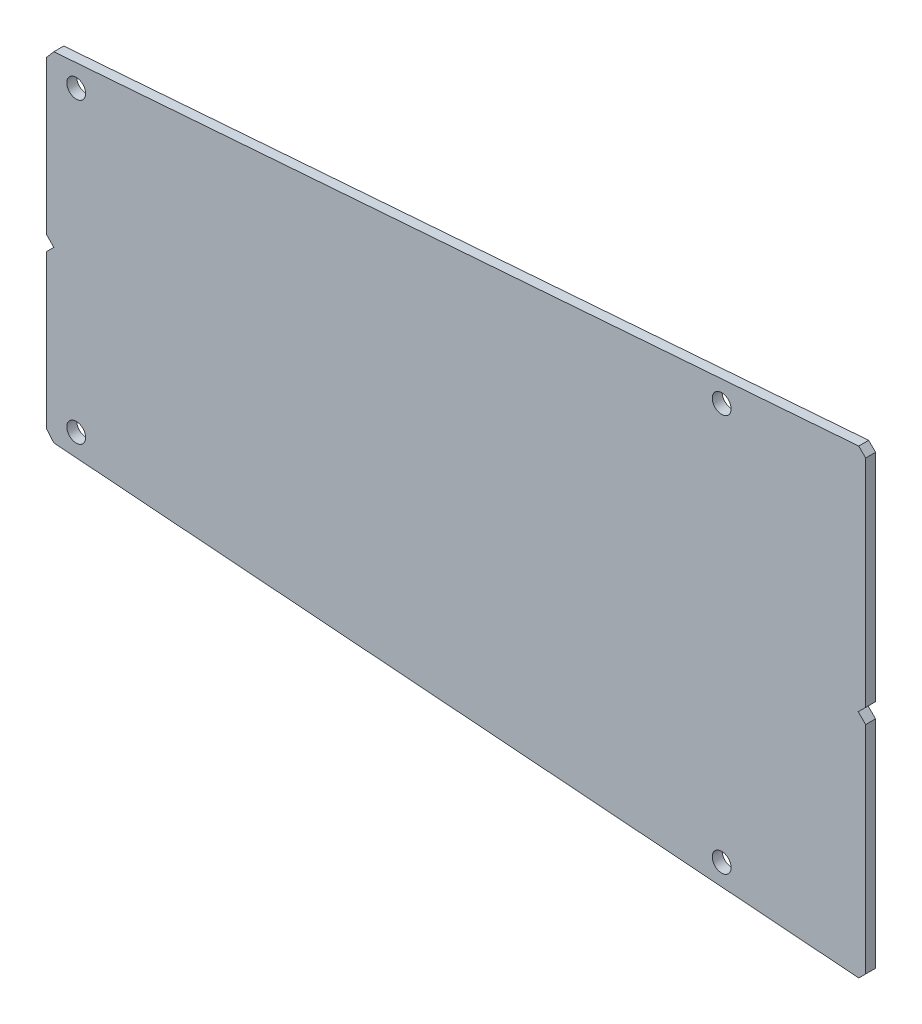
ISO-10303-21;
HEADER;
FILE_DESCRIPTION(('STEP AP214'),'2;1');
FILE_NAME('part.step','',(''),(''),'','','');
FILE_SCHEMA(('AUTOMOTIVE_DESIGN { 1 0 10303 214 1 1 1 1 }'));
ENDSEC;
DATA;
#1=APPLICATION_CONTEXT('core data for automotive mechanical design processes');
#2=APPLICATION_PROTOCOL_DEFINITION('international standard','automotive_design',2000,#1);
#3=PRODUCT_CONTEXT('',#1,'mechanical');
#4=PRODUCT('Part','Part','',(#3));
#5=PRODUCT_RELATED_PRODUCT_CATEGORY('part','',(#4));
#6=PRODUCT_DEFINITION_FORMATION('','',#4);
#7=PRODUCT_DEFINITION_CONTEXT('part definition',#1,'design');
#8=PRODUCT_DEFINITION('design','',#6,#7);
#9=PRODUCT_DEFINITION_SHAPE('','',#8);
#10=(LENGTH_UNIT() NAMED_UNIT(*) SI_UNIT(.MILLI.,.METRE.));
#11=(NAMED_UNIT(*) PLANE_ANGLE_UNIT() SI_UNIT($,.RADIAN.));
#12=(NAMED_UNIT(*) SI_UNIT($,.STERADIAN.) SOLID_ANGLE_UNIT());
#13=UNCERTAINTY_MEASURE_WITH_UNIT(LENGTH_MEASURE(1.E-05),#10,'distance_accuracy_value','');
#14=(GEOMETRIC_REPRESENTATION_CONTEXT(3) GLOBAL_UNCERTAINTY_ASSIGNED_CONTEXT((#13)) GLOBAL_UNIT_ASSIGNED_CONTEXT((#10,
#11,#12)) REPRESENTATION_CONTEXT('',''));
#15=CARTESIAN_POINT('',(0.,0.,0.));
#16=DIRECTION('',(0.,0.,1.));
#17=DIRECTION('',(1.,0.,0.));
#18=AXIS2_PLACEMENT_3D('',#15,#16,#17);
#19=CARTESIAN_POINT('',(-49.4388888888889,0.,2.));
#20=DIRECTION('',(0.,0.,1.));
#21=DIRECTION('',(1.,0.,0.));
#22=AXIS2_PLACEMENT_3D('',#19,#20,#21);
#23=PLANE('',#22);
#24=CARTESIAN_POINT('',(86.5611111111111,40.,2.));
#25=DIRECTION('',(0.,0.,1.));
#26=DIRECTION('',(1.,0.,0.));
#27=AXIS2_PLACEMENT_3D('',#24,#25,#26);
#28=CIRCLE('',#27,1.9);
#29=CARTESIAN_POINT('',(88.4611111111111,40.,2.));
#30=VERTEX_POINT('',#29);
#31=EDGE_CURVE('E203',#30,#30,#28,.T.);
#32=ORIENTED_EDGE('',*,*,#31,.F.);
#33=EDGE_LOOP('',(#32));
#34=FACE_BOUND('',#33,.T.);
#35=DIRECTION('',(-0.99714268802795,-0.0755411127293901,0.));
#36=VECTOR('',#35,1.);
#37=CARTESIAN_POINT('',(115.561111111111,46.5,2.));
#38=LINE('',#37,#36);
#39=CARTESIAN_POINT('',(114.166744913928,46.3943661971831,2.));
#40=VERTEX_POINT('',#39);
#41=CARTESIAN_POINT('',(-47.9431748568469,34.1133116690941,2.));
#42=VERTEX_POINT('',#41);
#43=EDGE_CURVE('E216',#40,#42,#38,.T.);
#44=ORIENTED_EDGE('',*,*,#43,.T.);
#45=DIRECTION('',(0.651670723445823,0.758501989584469,0.));
#46=VECTOR('',#45,1.);
#47=CARTESIAN_POINT('',(-65.4403564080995,13.7477396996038,2.));
#48=LINE('',#47,#46);
#49=CARTESIAN_POINT('',(-49.4388888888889,32.372398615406,2.));
#50=VERTEX_POINT('',#49);
#51=EDGE_CURVE('E11',#42,#50,#48,.F.);
#52=ORIENTED_EDGE('',*,*,#51,.T.);
#53=DIRECTION('',(0.,-1.,0.));
#54=VECTOR('',#53,1.);
#55=CARTESIAN_POINT('',(-49.4388888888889,34.,2.));
#56=LINE('',#55,#54);
#57=CARTESIAN_POINT('',(-49.4388888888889,1.50000000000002,2.));
#58=VERTEX_POINT('',#57);
#59=EDGE_CURVE('E212',#50,#58,#56,.T.);
#60=ORIENTED_EDGE('',*,*,#59,.T.);
#61=DIRECTION('',(-0.707106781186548,0.707106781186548,0.));
#62=VECTOR('',#61,1.);
#63=CARTESIAN_POINT('',(-48.6888888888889,0.750000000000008,2.));
#64=LINE('',#63,#62);
#65=CARTESIAN_POINT('',(-47.9388888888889,0.,2.));
#66=VERTEX_POINT('',#65);
#67=EDGE_CURVE('E242',#58,#66,#64,.F.);
#68=ORIENTED_EDGE('',*,*,#67,.T.);
#69=DIRECTION('',(-0.707106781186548,-0.707106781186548,0.));
#70=VECTOR('',#69,1.);
#71=CARTESIAN_POINT('',(-48.6888888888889,-0.750000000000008,2.));
#72=LINE('',#71,#70);
#73=CARTESIAN_POINT('',(-49.4388888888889,-1.50000000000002,2.));
#74=VERTEX_POINT('',#73);
#75=EDGE_CURVE('E183',#74,#66,#72,.F.);
#76=ORIENTED_EDGE('',*,*,#75,.F.);
#77=DIRECTION('',(0.,1.,0.));
#78=VECTOR('',#77,1.);
#79=CARTESIAN_POINT('',(-49.4388888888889,-34.,2.));
#80=LINE('',#79,#78);
#81=CARTESIAN_POINT('',(-49.4388888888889,-32.372398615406,2.));
#82=VERTEX_POINT('',#81);
#83=EDGE_CURVE('E151',#82,#74,#80,.T.);
#84=ORIENTED_EDGE('',*,*,#83,.F.);
#85=DIRECTION('',(0.651670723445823,-0.758501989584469,0.));
#86=VECTOR('',#85,1.);
#87=CARTESIAN_POINT('',(-65.4403564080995,-13.7477396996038,2.));
#88=LINE('',#87,#86);
#89=CARTESIAN_POINT('',(-47.9431748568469,-34.1133116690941,2.));
#90=VERTEX_POINT('',#89);
#91=EDGE_CURVE('E191',#90,#82,#88,.F.);
#92=ORIENTED_EDGE('',*,*,#91,.F.);
#93=DIRECTION('',(-0.99714268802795,0.0755411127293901,0.));
#94=VECTOR('',#93,1.);
#95=CARTESIAN_POINT('',(115.561111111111,-46.5,2.));
#96=LINE('',#95,#94);
#97=CARTESIAN_POINT('',(114.166744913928,-46.3943661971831,2.));
#98=VERTEX_POINT('',#97);
#99=EDGE_CURVE('E143',#98,#90,#96,.T.);
#100=ORIENTED_EDGE('',*,*,#99,.F.);
#101=DIRECTION('',(0.707106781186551,0.707106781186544,0.));
#102=VECTOR('',#101,1.);
#103=CARTESIAN_POINT('',(55.5611111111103,-105.,2.));
#104=LINE('',#103,#102);
#105=CARTESIAN_POINT('',(115.561111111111,-45.,2.));
#106=VERTEX_POINT('',#105);
#107=EDGE_CURVE('E139',#106,#98,#104,.F.);
#108=ORIENTED_EDGE('',*,*,#107,.F.);
#109=DIRECTION('',(0.,-1.,0.));
#110=VECTOR('',#109,1.);
#111=CARTESIAN_POINT('',(115.561111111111,0.,2.));
#112=LINE('',#111,#110);
#113=CARTESIAN_POINT('',(115.561111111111,-1.50000000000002,2.));
#114=VERTEX_POINT('',#113);
#115=EDGE_CURVE('E462',#114,#106,#112,.T.);
#116=ORIENTED_EDGE('',*,*,#115,.F.);
#117=DIRECTION('',(-0.707106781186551,0.707106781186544,0.));
#118=VECTOR('',#117,1.);
#119=CARTESIAN_POINT('',(32.3111111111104,81.75,2.));
#120=LINE('',#119,#118);
#121=CARTESIAN_POINT('',(114.061111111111,0.,2.));
#122=VERTEX_POINT('',#121);
#123=EDGE_CURVE('E172',#122,#114,#120,.F.);
#124=ORIENTED_EDGE('',*,*,#123,.F.);
#125=DIRECTION('',(-0.707106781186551,-0.707106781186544,0.));
#126=VECTOR('',#125,1.);
#127=CARTESIAN_POINT('',(32.3111111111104,-81.75,2.));
#128=LINE('',#127,#126);
#129=CARTESIAN_POINT('',(115.561111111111,1.50000000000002,2.));
#130=VERTEX_POINT('',#129);
#131=EDGE_CURVE('E234',#122,#130,#128,.F.);
#132=ORIENTED_EDGE('',*,*,#131,.T.);
#133=DIRECTION('',(0.,1.,0.));
#134=VECTOR('',#133,1.);
#135=CARTESIAN_POINT('',(115.561111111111,0.,2.));
#136=LINE('',#135,#134);
#137=CARTESIAN_POINT('',(115.561111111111,45.,2.));
#138=VERTEX_POINT('',#137);
#139=EDGE_CURVE('E214',#130,#138,#136,.T.);
#140=ORIENTED_EDGE('',*,*,#139,.T.);
#141=DIRECTION('',(0.707106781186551,-0.707106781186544,0.));
#142=VECTOR('',#141,1.);
#143=CARTESIAN_POINT('',(55.5611111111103,105.,2.));
#144=LINE('',#143,#142);
#145=EDGE_CURVE('E227',#138,#40,#144,.F.);
#146=ORIENTED_EDGE('',*,*,#145,.T.);
#147=EDGE_LOOP('',(#44,#52,#60,#68,#76,#84,#92,#100,#108,#116,#124,#132,#140,#146));
#148=FACE_BOUND('',#147,.T.);
#149=CARTESIAN_POINT('',(-43.4388888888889,30.,2.));
#150=DIRECTION('',(0.,0.,1.));
#151=DIRECTION('',(1.,0.,0.));
#152=AXIS2_PLACEMENT_3D('',#149,#150,#151);
#153=CIRCLE('',#152,1.9);
#154=CARTESIAN_POINT('',(-41.5388888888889,30.,2.));
#155=VERTEX_POINT('',#154);
#156=EDGE_CURVE('E197',#155,#155,#153,.T.);
#157=ORIENTED_EDGE('',*,*,#156,.F.);
#158=EDGE_LOOP('',(#157));
#159=FACE_BOUND('',#158,.T.);
#160=CARTESIAN_POINT('',(86.5611111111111,-40.,2.));
#161=DIRECTION('',(0.,0.,-1.));
#162=DIRECTION('',(1.,0.,0.));
#163=AXIS2_PLACEMENT_3D('',#160,#161,#162);
#164=CIRCLE('',#163,1.9);
#165=CARTESIAN_POINT('',(88.4611111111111,-40.,2.));
#166=VERTEX_POINT('',#165);
#167=EDGE_CURVE('E470',#166,#166,#164,.T.);
#168=ORIENTED_EDGE('',*,*,#167,.T.);
#169=EDGE_LOOP('',(#168));
#170=FACE_BOUND('',#169,.T.);
#171=CARTESIAN_POINT('',(-43.4388888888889,-30.,2.));
#172=DIRECTION('',(0.,0.,-1.));
#173=DIRECTION('',(1.,0.,0.));
#174=AXIS2_PLACEMENT_3D('',#171,#172,#173);
#175=CIRCLE('',#174,1.9);
#176=CARTESIAN_POINT('',(-41.5388888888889,-30.,2.));
#177=VERTEX_POINT('',#176);
#178=EDGE_CURVE('E478',#177,#177,#175,.T.);
#179=ORIENTED_EDGE('',*,*,#178,.T.);
#180=EDGE_LOOP('',(#179));
#181=FACE_BOUND('',#180,.T.);
#182=ADVANCED_FACE('F31',(#34,#148,#159,#170,#181),#23,.T.);
#183=CARTESIAN_POINT('',(-49.4388888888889,0.,0.));
#184=DIRECTION('',(0.,0.,1.));
#185=DIRECTION('',(1.,0.,0.));
#186=AXIS2_PLACEMENT_3D('',#183,#184,#185);
#187=PLANE('',#186);
#188=CARTESIAN_POINT('',(86.5611111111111,40.,0.));
#189=DIRECTION('',(0.,0.,1.));
#190=DIRECTION('',(1.,0.,0.));
#191=AXIS2_PLACEMENT_3D('',#188,#189,#190);
#192=CIRCLE('',#191,1.9);
#193=CARTESIAN_POINT('',(88.4611111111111,40.,0.));
#194=VERTEX_POINT('',#193);
#195=EDGE_CURVE('E200',#194,#194,#192,.T.);
#196=ORIENTED_EDGE('',*,*,#195,.T.);
#197=EDGE_LOOP('',(#196));
#198=FACE_BOUND('',#197,.T.);
#199=DIRECTION('',(0.,-1.,0.));
#200=VECTOR('',#199,1.);
#201=CARTESIAN_POINT('',(-49.4388888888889,34.,0.));
#202=LINE('',#201,#200);
#203=CARTESIAN_POINT('',(-49.4388888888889,32.372398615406,0.));
#204=VERTEX_POINT('',#203);
#205=CARTESIAN_POINT('',(-49.4388888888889,1.50000000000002,0.));
#206=VERTEX_POINT('',#205);
#207=EDGE_CURVE('E206',#204,#206,#202,.T.);
#208=ORIENTED_EDGE('',*,*,#207,.F.);
#209=DIRECTION('',(-0.651670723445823,-0.758501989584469,0.));
#210=VECTOR('',#209,1.);
#211=CARTESIAN_POINT('',(-49.4388888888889,32.372398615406,0.));
#212=LINE('',#211,#210);
#213=CARTESIAN_POINT('',(-47.943174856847,34.1133116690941,0.));
#214=VERTEX_POINT('',#213);
#215=EDGE_CURVE('E53',#204,#214,#212,.F.);
#216=ORIENTED_EDGE('',*,*,#215,.T.);
#217=DIRECTION('',(-0.99714268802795,-0.0755411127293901,0.));
#218=VECTOR('',#217,1.);
#219=CARTESIAN_POINT('',(115.561111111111,46.5,0.));
#220=LINE('',#219,#218);
#221=CARTESIAN_POINT('',(114.166744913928,46.3943661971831,0.));
#222=VERTEX_POINT('',#221);
#223=EDGE_CURVE('E210',#222,#214,#220,.T.);
#224=ORIENTED_EDGE('',*,*,#223,.F.);
#225=DIRECTION('',(-0.707106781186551,0.707106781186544,0.));
#226=VECTOR('',#225,1.);
#227=CARTESIAN_POINT('',(114.166744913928,46.3943661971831,0.));
#228=LINE('',#227,#226);
#229=CARTESIAN_POINT('',(115.561111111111,45.,0.));
#230=VERTEX_POINT('',#229);
#231=EDGE_CURVE('E221',#222,#230,#228,.F.);
#232=ORIENTED_EDGE('',*,*,#231,.T.);
#233=DIRECTION('',(0.,1.,0.));
#234=VECTOR('',#233,1.);
#235=CARTESIAN_POINT('',(115.561111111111,0.,0.));
#236=LINE('',#235,#234);
#237=CARTESIAN_POINT('',(115.561111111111,1.49999999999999,0.));
#238=VERTEX_POINT('',#237);
#239=EDGE_CURVE('E208',#238,#230,#236,.T.);
#240=ORIENTED_EDGE('',*,*,#239,.F.);
#241=DIRECTION('',(0.707106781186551,0.707106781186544,0.));
#242=VECTOR('',#241,1.);
#243=CARTESIAN_POINT('',(115.561111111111,1.49999999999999,0.));
#244=LINE('',#243,#242);
#245=CARTESIAN_POINT('',(114.061111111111,0.,0.));
#246=VERTEX_POINT('',#245);
#247=EDGE_CURVE('E232',#238,#246,#244,.F.);
#248=ORIENTED_EDGE('',*,*,#247,.T.);
#249=DIRECTION('',(0.707106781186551,-0.707106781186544,0.));
#250=VECTOR('',#249,1.);
#251=CARTESIAN_POINT('',(115.561111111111,-1.49999999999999,0.));
#252=LINE('',#251,#250);
#253=CARTESIAN_POINT('',(115.561111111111,-1.49999999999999,0.));
#254=VERTEX_POINT('',#253);
#255=EDGE_CURVE('E166',#254,#246,#252,.F.);
#256=ORIENTED_EDGE('',*,*,#255,.F.);
#257=DIRECTION('',(0.,-1.,0.));
#258=VECTOR('',#257,1.);
#259=CARTESIAN_POINT('',(115.561111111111,0.,0.));
#260=LINE('',#259,#258);
#261=CARTESIAN_POINT('',(115.561111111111,-45.,0.));
#262=VERTEX_POINT('',#261);
#263=EDGE_CURVE('E152',#254,#262,#260,.T.);
#264=ORIENTED_EDGE('',*,*,#263,.T.);
#265=DIRECTION('',(-0.707106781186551,-0.707106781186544,0.));
#266=VECTOR('',#265,1.);
#267=CARTESIAN_POINT('',(114.166744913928,-46.3943661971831,0.));
#268=LINE('',#267,#266);
#269=CARTESIAN_POINT('',(114.166744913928,-46.3943661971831,0.));
#270=VERTEX_POINT('',#269);
#271=EDGE_CURVE('E136',#270,#262,#268,.F.);
#272=ORIENTED_EDGE('',*,*,#271,.F.);
#273=DIRECTION('',(-0.99714268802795,0.0755411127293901,0.));
#274=VECTOR('',#273,1.);
#275=CARTESIAN_POINT('',(115.561111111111,-46.5,0.));
#276=LINE('',#275,#274);
#277=CARTESIAN_POINT('',(-47.943174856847,-34.1133116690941,0.));
#278=VERTEX_POINT('',#277);
#279=EDGE_CURVE('E146',#270,#278,#276,.T.);
#280=ORIENTED_EDGE('',*,*,#279,.T.);
#281=DIRECTION('',(-0.651670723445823,0.758501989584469,0.));
#282=VECTOR('',#281,1.);
#283=CARTESIAN_POINT('',(-49.4388888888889,-32.372398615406,0.));
#284=LINE('',#283,#282);
#285=CARTESIAN_POINT('',(-49.4388888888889,-32.372398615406,0.));
#286=VERTEX_POINT('',#285);
#287=EDGE_CURVE('E188',#286,#278,#284,.F.);
#288=ORIENTED_EDGE('',*,*,#287,.F.);
#289=DIRECTION('',(0.,1.,0.));
#290=VECTOR('',#289,1.);
#291=CARTESIAN_POINT('',(-49.4388888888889,-34.,0.));
#292=LINE('',#291,#290);
#293=CARTESIAN_POINT('',(-49.4388888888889,-1.50000000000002,0.));
#294=VERTEX_POINT('',#293);
#295=EDGE_CURVE('E469',#286,#294,#292,.T.);
#296=ORIENTED_EDGE('',*,*,#295,.T.);
#297=DIRECTION('',(0.707106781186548,0.707106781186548,0.));
#298=VECTOR('',#297,1.);
#299=CARTESIAN_POINT('',(-47.9388888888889,0.,0.));
#300=LINE('',#299,#298);
#301=CARTESIAN_POINT('',(-47.9388888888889,0.,0.));
#302=VERTEX_POINT('',#301);
#303=EDGE_CURVE('E178',#302,#294,#300,.F.);
#304=ORIENTED_EDGE('',*,*,#303,.F.);
#305=DIRECTION('',(0.707106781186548,-0.707106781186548,0.));
#306=VECTOR('',#305,1.);
#307=CARTESIAN_POINT('',(-47.9388888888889,0.,0.));
#308=LINE('',#307,#306);
#309=EDGE_CURVE('E236',#302,#206,#308,.F.);
#310=ORIENTED_EDGE('',*,*,#309,.T.);
#311=EDGE_LOOP('',(#208,#216,#224,#232,#240,#248,#256,#264,#272,#280,#288,#296,#304,#310));
#312=FACE_BOUND('',#311,.T.);
#313=CARTESIAN_POINT('',(-43.4388888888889,30.,0.));
#314=DIRECTION('',(0.,0.,1.));
#315=DIRECTION('',(1.,0.,0.));
#316=AXIS2_PLACEMENT_3D('',#313,#314,#315);
#317=CIRCLE('',#316,1.9);
#318=CARTESIAN_POINT('',(-41.5388888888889,30.,0.));
#319=VERTEX_POINT('',#318);
#320=EDGE_CURVE('E194',#319,#319,#317,.T.);
#321=ORIENTED_EDGE('',*,*,#320,.T.);
#322=EDGE_LOOP('',(#321));
#323=FACE_BOUND('',#322,.T.);
#324=CARTESIAN_POINT('',(86.5611111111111,-40.,0.));
#325=DIRECTION('',(0.,0.,-1.));
#326=DIRECTION('',(1.,0.,0.));
#327=AXIS2_PLACEMENT_3D('',#324,#325,#326);
#328=CIRCLE('',#327,1.9);
#329=CARTESIAN_POINT('',(88.4611111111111,-40.,0.));
#330=VERTEX_POINT('',#329);
#331=EDGE_CURVE('E475',#330,#330,#328,.T.);
#332=ORIENTED_EDGE('',*,*,#331,.F.);
#333=EDGE_LOOP('',(#332));
#334=FACE_BOUND('',#333,.T.);
#335=CARTESIAN_POINT('',(-43.4388888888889,-30.,0.));
#336=DIRECTION('',(0.,0.,-1.));
#337=DIRECTION('',(1.,0.,0.));
#338=AXIS2_PLACEMENT_3D('',#335,#336,#337);
#339=CIRCLE('',#338,1.9);
#340=CARTESIAN_POINT('',(-41.5388888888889,-30.,0.));
#341=VERTEX_POINT('',#340);
#342=EDGE_CURVE('E481',#341,#341,#339,.T.);
#343=ORIENTED_EDGE('',*,*,#342,.F.);
#344=EDGE_LOOP('',(#343));
#345=FACE_BOUND('',#344,.T.);
#346=ADVANCED_FACE('F154',(#198,#312,#323,#334,#345),#187,.F.);
#347=CARTESIAN_POINT('',(-49.4388888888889,34.,2.));
#348=DIRECTION('',(1.,0.,0.));
#349=DIRECTION('',(0.,1.,0.));
#350=AXIS2_PLACEMENT_3D('',#347,#348,#349);
#351=PLANE('',#350);
#352=ORIENTED_EDGE('',*,*,#59,.F.);
#353=DIRECTION('',(0.,0.,-1.));
#354=VECTOR('',#353,1.);
#355=CARTESIAN_POINT('',(-49.4388888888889,32.372398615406,2.));
#356=LINE('',#355,#354);
#357=EDGE_CURVE('E244',#50,#204,#356,.T.);
#358=ORIENTED_EDGE('',*,*,#357,.T.);
#359=ORIENTED_EDGE('',*,*,#207,.T.);
#360=DIRECTION('',(0.,0.,1.));
#361=VECTOR('',#360,1.);
#362=CARTESIAN_POINT('',(-49.4388888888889,1.50000000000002,2.));
#363=LINE('',#362,#361);
#364=EDGE_CURVE('E239',#206,#58,#363,.T.);
#365=ORIENTED_EDGE('',*,*,#364,.T.);
#366=EDGE_LOOP('',(#352,#358,#359,#365));
#367=FACE_BOUND('',#366,.T.);
#368=ADVANCED_FACE('F33',(#367),#351,.F.);
#369=CARTESIAN_POINT('',(115.561111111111,0.,2.));
#370=DIRECTION('',(-1.,0.,0.));
#371=DIRECTION('',(0.,0.,1.));
#372=AXIS2_PLACEMENT_3D('',#369,#370,#371);
#373=PLANE('',#372);
#374=ORIENTED_EDGE('',*,*,#139,.F.);
#375=DIRECTION('',(0.,0.,-1.));
#376=VECTOR('',#375,1.);
#377=CARTESIAN_POINT('',(115.561111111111,1.49999999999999,2.));
#378=LINE('',#377,#376);
#379=EDGE_CURVE('E229',#130,#238,#378,.T.);
#380=ORIENTED_EDGE('',*,*,#379,.T.);
#381=ORIENTED_EDGE('',*,*,#239,.T.);
#382=DIRECTION('',(0.,0.,1.));
#383=VECTOR('',#382,1.);
#384=CARTESIAN_POINT('',(115.561111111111,45.,2.));
#385=LINE('',#384,#383);
#386=EDGE_CURVE('E224',#230,#138,#385,.T.);
#387=ORIENTED_EDGE('',*,*,#386,.T.);
#388=EDGE_LOOP('',(#374,#380,#381,#387));
#389=FACE_BOUND('',#388,.T.);
#390=ADVANCED_FACE('F290',(#389),#373,.F.);
#391=CARTESIAN_POINT('',(115.561111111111,46.5,2.));
#392=DIRECTION('',(0.0755411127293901,-0.99714268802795,0.));
#393=DIRECTION('',(0.99714268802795,0.0755411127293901,0.));
#394=AXIS2_PLACEMENT_3D('',#391,#392,#393);
#395=PLANE('',#394);
#396=ORIENTED_EDGE('',*,*,#223,.T.);
#397=DIRECTION('',(0.,0.,1.));
#398=VECTOR('',#397,1.);
#399=CARTESIAN_POINT('',(-47.943174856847,34.1133116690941,2.));
#400=LINE('',#399,#398);
#401=EDGE_CURVE('E39',#214,#42,#400,.T.);
#402=ORIENTED_EDGE('',*,*,#401,.T.);
#403=ORIENTED_EDGE('',*,*,#43,.F.);
#404=DIRECTION('',(0.,0.,-1.));
#405=VECTOR('',#404,1.);
#406=CARTESIAN_POINT('',(114.166744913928,46.3943661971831,2.));
#407=LINE('',#406,#405);
#408=EDGE_CURVE('E218',#40,#222,#407,.T.);
#409=ORIENTED_EDGE('',*,*,#408,.T.);
#410=EDGE_LOOP('',(#396,#402,#403,#409));
#411=FACE_BOUND('',#410,.T.);
#412=ADVANCED_FACE('F287',(#411),#395,.F.);
#413=CARTESIAN_POINT('',(86.5611111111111,40.,2.));
#414=DIRECTION('',(0.,0.,-1.));
#415=DIRECTION('',(-1.,0.,0.));
#416=AXIS2_PLACEMENT_3D('',#413,#414,#415);
#417=CYLINDRICAL_SURFACE('',#416,1.9);
#418=ORIENTED_EDGE('',*,*,#31,.T.);
#419=EDGE_LOOP('',(#418));
#420=FACE_BOUND('',#419,.T.);
#421=ORIENTED_EDGE('',*,*,#195,.F.);
#422=EDGE_LOOP('',(#421));
#423=FACE_BOUND('',#422,.T.);
#424=ADVANCED_FACE('F289',(#420,#423),#417,.F.);
#425=CARTESIAN_POINT('',(-43.4388888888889,30.,2.));
#426=DIRECTION('',(0.,0.,-1.));
#427=DIRECTION('',(-1.,0.,0.));
#428=AXIS2_PLACEMENT_3D('',#425,#426,#427);
#429=CYLINDRICAL_SURFACE('',#428,1.9);
#430=ORIENTED_EDGE('',*,*,#156,.T.);
#431=EDGE_LOOP('',(#430));
#432=FACE_BOUND('',#431,.T.);
#433=ORIENTED_EDGE('',*,*,#320,.F.);
#434=EDGE_LOOP('',(#433));
#435=FACE_BOUND('',#434,.T.);
#436=ADVANCED_FACE('F307',(#432,#435),#429,.F.);
#437=CARTESIAN_POINT('',(114.166744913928,46.3943661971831,2.));
#438=DIRECTION('',(-0.707106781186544,-0.707106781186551,0.));
#439=DIRECTION('',(0.707106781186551,-0.707106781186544,0.));
#440=AXIS2_PLACEMENT_3D('',#437,#438,#439);
#441=PLANE('',#440);
#442=ORIENTED_EDGE('',*,*,#145,.F.);
#443=ORIENTED_EDGE('',*,*,#386,.F.);
#444=ORIENTED_EDGE('',*,*,#231,.F.);
#445=ORIENTED_EDGE('',*,*,#408,.F.);
#446=EDGE_LOOP('',(#442,#443,#444,#445));
#447=FACE_BOUND('',#446,.T.);
#448=ADVANCED_FACE('F305',(#447),#441,.F.);
#449=CARTESIAN_POINT('',(115.561111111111,1.49999999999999,2.));
#450=DIRECTION('',(-0.707106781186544,0.707106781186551,0.));
#451=DIRECTION('',(-0.707106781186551,-0.707106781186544,0.));
#452=AXIS2_PLACEMENT_3D('',#449,#450,#451);
#453=PLANE('',#452);
#454=ORIENTED_EDGE('',*,*,#131,.F.);
#455=DIRECTION('',(0.,0.,1.));
#456=VECTOR('',#455,1.);
#457=CARTESIAN_POINT('',(114.061111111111,0.,2.));
#458=LINE('',#457,#456);
#459=EDGE_CURVE('E169',#246,#122,#458,.T.);
#460=ORIENTED_EDGE('',*,*,#459,.F.);
#461=ORIENTED_EDGE('',*,*,#247,.F.);
#462=ORIENTED_EDGE('',*,*,#379,.F.);
#463=EDGE_LOOP('',(#454,#460,#461,#462));
#464=FACE_BOUND('',#463,.T.);
#465=ADVANCED_FACE('F274',(#464),#453,.F.);
#466=CARTESIAN_POINT('',(-47.9388888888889,0.,2.));
#467=DIRECTION('',(0.707106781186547,0.707106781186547,0.));
#468=DIRECTION('',(-0.707106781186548,0.707106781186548,0.));
#469=AXIS2_PLACEMENT_3D('',#466,#467,#468);
#470=PLANE('',#469);
#471=ORIENTED_EDGE('',*,*,#67,.F.);
#472=ORIENTED_EDGE('',*,*,#364,.F.);
#473=ORIENTED_EDGE('',*,*,#309,.F.);
#474=DIRECTION('',(0.,0.,-1.));
#475=VECTOR('',#474,1.);
#476=CARTESIAN_POINT('',(-47.9388888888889,0.,2.));
#477=LINE('',#476,#475);
#478=EDGE_CURVE('E175',#66,#302,#477,.T.);
#479=ORIENTED_EDGE('',*,*,#478,.F.);
#480=EDGE_LOOP('',(#471,#472,#473,#479));
#481=FACE_BOUND('',#480,.T.);
#482=ADVANCED_FACE('F258',(#481),#470,.F.);
#483=CARTESIAN_POINT('',(-49.4388888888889,32.372398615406,2.));
#484=DIRECTION('',(0.758501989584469,-0.651670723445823,0.));
#485=DIRECTION('',(0.651670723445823,0.758501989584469,0.));
#486=AXIS2_PLACEMENT_3D('',#483,#484,#485);
#487=PLANE('',#486);
#488=ORIENTED_EDGE('',*,*,#51,.F.);
#489=ORIENTED_EDGE('',*,*,#401,.F.);
#490=ORIENTED_EDGE('',*,*,#215,.F.);
#491=ORIENTED_EDGE('',*,*,#357,.F.);
#492=EDGE_LOOP('',(#488,#489,#490,#491));
#493=FACE_BOUND('',#492,.T.);
#494=ADVANCED_FACE('F263',(#493),#487,.F.);
#495=CARTESIAN_POINT('',(-49.4388888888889,-34.,2.));
#496=DIRECTION('',(1.,0.,0.));
#497=DIRECTION('',(0.,-1.,0.));
#498=AXIS2_PLACEMENT_3D('',#495,#496,#497);
#499=PLANE('',#498);
#500=ORIENTED_EDGE('',*,*,#83,.T.);
#501=DIRECTION('',(0.,0.,1.));
#502=VECTOR('',#501,1.);
#503=CARTESIAN_POINT('',(-49.4388888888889,-1.50000000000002,2.));
#504=LINE('',#503,#502);
#505=EDGE_CURVE('E181',#294,#74,#504,.T.);
#506=ORIENTED_EDGE('',*,*,#505,.F.);
#507=ORIENTED_EDGE('',*,*,#295,.F.);
#508=DIRECTION('',(0.,0.,-1.));
#509=VECTOR('',#508,1.);
#510=CARTESIAN_POINT('',(-49.4388888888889,-32.372398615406,2.));
#511=LINE('',#510,#509);
#512=EDGE_CURVE('E186',#82,#286,#511,.T.);
#513=ORIENTED_EDGE('',*,*,#512,.F.);
#514=EDGE_LOOP('',(#500,#506,#507,#513));
#515=FACE_BOUND('',#514,.T.);
#516=ADVANCED_FACE('F265',(#515),#499,.F.);
#517=CARTESIAN_POINT('',(115.561111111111,0.,2.));
#518=DIRECTION('',(-1.,0.,0.));
#519=DIRECTION('',(0.,0.,1.));
#520=AXIS2_PLACEMENT_3D('',#517,#518,#519);
#521=PLANE('',#520);
#522=ORIENTED_EDGE('',*,*,#115,.T.);
#523=DIRECTION('',(0.,0.,1.));
#524=VECTOR('',#523,1.);
#525=CARTESIAN_POINT('',(115.561111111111,-45.,2.));
#526=LINE('',#525,#524);
#527=EDGE_CURVE('E158',#262,#106,#526,.T.);
#528=ORIENTED_EDGE('',*,*,#527,.F.);
#529=ORIENTED_EDGE('',*,*,#263,.F.);
#530=DIRECTION('',(0.,0.,-1.));
#531=VECTOR('',#530,1.);
#532=CARTESIAN_POINT('',(115.561111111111,-1.49999999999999,2.));
#533=LINE('',#532,#531);
#534=EDGE_CURVE('E164',#114,#254,#533,.T.);
#535=ORIENTED_EDGE('',*,*,#534,.F.);
#536=EDGE_LOOP('',(#522,#528,#529,#535));
#537=FACE_BOUND('',#536,.T.);
#538=ADVANCED_FACE('F271',(#537),#521,.F.);
#539=CARTESIAN_POINT('',(115.561111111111,-46.5,2.));
#540=DIRECTION('',(0.0755411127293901,0.99714268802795,0.));
#541=DIRECTION('',(0.99714268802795,-0.0755411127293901,0.));
#542=AXIS2_PLACEMENT_3D('',#539,#540,#541);
#543=PLANE('',#542);
#544=ORIENTED_EDGE('',*,*,#279,.F.);
#545=DIRECTION('',(0.,0.,-1.));
#546=VECTOR('',#545,1.);
#547=CARTESIAN_POINT('',(114.166744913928,-46.3943661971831,2.));
#548=LINE('',#547,#546);
#549=EDGE_CURVE('E132',#98,#270,#548,.T.);
#550=ORIENTED_EDGE('',*,*,#549,.F.);
#551=ORIENTED_EDGE('',*,*,#99,.T.);
#552=DIRECTION('',(0.,0.,1.));
#553=VECTOR('',#552,1.);
#554=CARTESIAN_POINT('',(-47.943174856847,-34.1133116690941,2.));
#555=LINE('',#554,#553);
#556=EDGE_CURVE('E148',#278,#90,#555,.T.);
#557=ORIENTED_EDGE('',*,*,#556,.F.);
#558=EDGE_LOOP('',(#544,#550,#551,#557));
#559=FACE_BOUND('',#558,.T.);
#560=ADVANCED_FACE('F147',(#559),#543,.F.);
#561=CARTESIAN_POINT('',(86.5611111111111,-40.,2.));
#562=DIRECTION('',(0.,0.,-1.));
#563=DIRECTION('',(-1.,0.,0.));
#564=AXIS2_PLACEMENT_3D('',#561,#562,#563);
#565=CYLINDRICAL_SURFACE('',#564,1.9);
#566=ORIENTED_EDGE('',*,*,#167,.F.);
#567=EDGE_LOOP('',(#566));
#568=FACE_BOUND('',#567,.T.);
#569=ORIENTED_EDGE('',*,*,#331,.T.);
#570=EDGE_LOOP('',(#569));
#571=FACE_BOUND('',#570,.T.);
#572=ADVANCED_FACE('F399',(#568,#571),#565,.F.);
#573=CARTESIAN_POINT('',(-43.4388888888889,-30.,2.));
#574=DIRECTION('',(0.,0.,-1.));
#575=DIRECTION('',(-1.,0.,0.));
#576=AXIS2_PLACEMENT_3D('',#573,#574,#575);
#577=CYLINDRICAL_SURFACE('',#576,1.9);
#578=ORIENTED_EDGE('',*,*,#178,.F.);
#579=EDGE_LOOP('',(#578));
#580=FACE_BOUND('',#579,.T.);
#581=ORIENTED_EDGE('',*,*,#342,.T.);
#582=EDGE_LOOP('',(#581));
#583=FACE_BOUND('',#582,.T.);
#584=ADVANCED_FACE('F408',(#580,#583),#577,.F.);
#585=CARTESIAN_POINT('',(114.166744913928,-46.3943661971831,2.));
#586=DIRECTION('',(-0.707106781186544,0.707106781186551,0.));
#587=DIRECTION('',(0.707106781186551,0.707106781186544,0.));
#588=AXIS2_PLACEMENT_3D('',#585,#586,#587);
#589=PLANE('',#588);
#590=ORIENTED_EDGE('',*,*,#107,.T.);
#591=ORIENTED_EDGE('',*,*,#549,.T.);
#592=ORIENTED_EDGE('',*,*,#271,.T.);
#593=ORIENTED_EDGE('',*,*,#527,.T.);
#594=EDGE_LOOP('',(#590,#591,#592,#593));
#595=FACE_BOUND('',#594,.T.);
#596=ADVANCED_FACE('F134',(#595),#589,.F.);
#597=CARTESIAN_POINT('',(115.561111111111,-1.49999999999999,2.));
#598=DIRECTION('',(-0.707106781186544,-0.707106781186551,0.));
#599=DIRECTION('',(-0.707106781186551,0.707106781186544,0.));
#600=AXIS2_PLACEMENT_3D('',#597,#598,#599);
#601=PLANE('',#600);
#602=ORIENTED_EDGE('',*,*,#123,.T.);
#603=ORIENTED_EDGE('',*,*,#534,.T.);
#604=ORIENTED_EDGE('',*,*,#255,.T.);
#605=ORIENTED_EDGE('',*,*,#459,.T.);
#606=EDGE_LOOP('',(#602,#603,#604,#605));
#607=FACE_BOUND('',#606,.T.);
#608=ADVANCED_FACE('F427',(#607),#601,.F.);
#609=CARTESIAN_POINT('',(-47.9388888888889,0.,2.));
#610=DIRECTION('',(0.707106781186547,-0.707106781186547,0.));
#611=DIRECTION('',(-0.707106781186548,-0.707106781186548,0.));
#612=AXIS2_PLACEMENT_3D('',#609,#610,#611);
#613=PLANE('',#612);
#614=ORIENTED_EDGE('',*,*,#75,.T.);
#615=ORIENTED_EDGE('',*,*,#478,.T.);
#616=ORIENTED_EDGE('',*,*,#303,.T.);
#617=ORIENTED_EDGE('',*,*,#505,.T.);
#618=EDGE_LOOP('',(#614,#615,#616,#617));
#619=FACE_BOUND('',#618,.T.);
#620=ADVANCED_FACE('F436',(#619),#613,.F.);
#621=CARTESIAN_POINT('',(-49.4388888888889,-32.372398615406,2.));
#622=DIRECTION('',(0.758501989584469,0.651670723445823,0.));
#623=DIRECTION('',(0.651670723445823,-0.758501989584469,0.));
#624=AXIS2_PLACEMENT_3D('',#621,#622,#623);
#625=PLANE('',#624);
#626=ORIENTED_EDGE('',*,*,#91,.T.);
#627=ORIENTED_EDGE('',*,*,#512,.T.);
#628=ORIENTED_EDGE('',*,*,#287,.T.);
#629=ORIENTED_EDGE('',*,*,#556,.T.);
#630=EDGE_LOOP('',(#626,#627,#628,#629));
#631=FACE_BOUND('',#630,.T.);
#632=ADVANCED_FACE('F446',(#631),#625,.F.);
#633=CLOSED_SHELL('',(#182,#346,#368,#390,#412,#424,#436,#448,#465,#482,#494,#516,#538,#560,
#572,#584,#596,#608,#620,#632));
#634=MANIFOLD_SOLID_BREP('B2',#633);
#635=ADVANCED_BREP_SHAPE_REPRESENTATION('',(#18,#634),#14);
#636=SHAPE_DEFINITION_REPRESENTATION(#9,#635);
ENDSEC;
END-ISO-10303-21;
